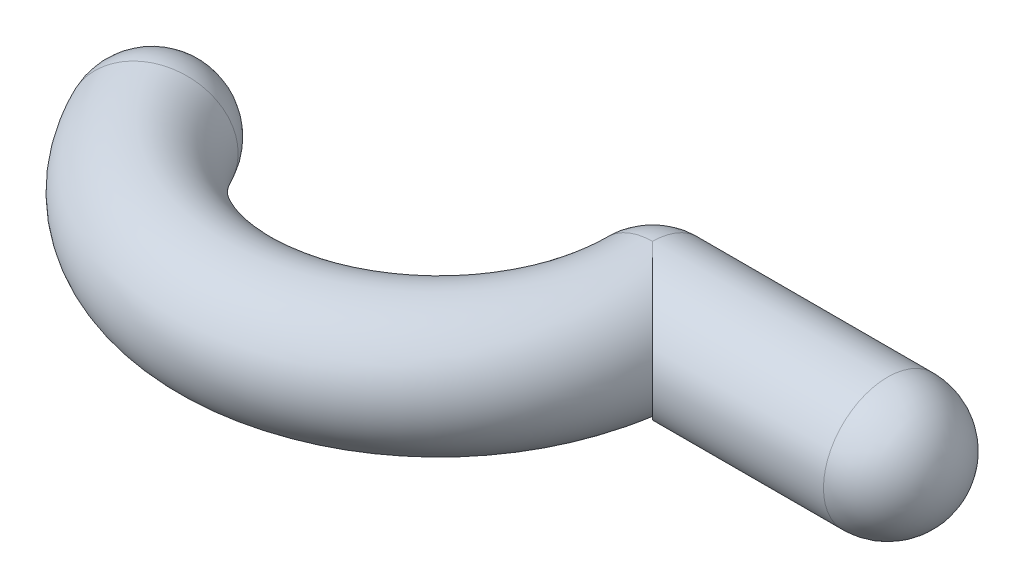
ISO-10303-21;
HEADER;
FILE_DESCRIPTION(('STEP AP214'),'2;1');
FILE_NAME('part.step','',(''),(''),'','','');
FILE_SCHEMA(('AUTOMOTIVE_DESIGN { 1 0 10303 214 1 1 1 1 }'));
ENDSEC;
DATA;
#1=APPLICATION_CONTEXT('core data for automotive mechanical design processes');
#2=APPLICATION_PROTOCOL_DEFINITION('international standard','automotive_design',2000,#1);
#3=PRODUCT_CONTEXT('',#1,'mechanical');
#4=PRODUCT('Part','Part','',(#3));
#5=PRODUCT_RELATED_PRODUCT_CATEGORY('part','',(#4));
#6=PRODUCT_DEFINITION_FORMATION('','',#4);
#7=PRODUCT_DEFINITION_CONTEXT('part definition',#1,'design');
#8=PRODUCT_DEFINITION('design','',#6,#7);
#9=PRODUCT_DEFINITION_SHAPE('','',#8);
#10=(LENGTH_UNIT() NAMED_UNIT(*) SI_UNIT(.MILLI.,.METRE.));
#11=(NAMED_UNIT(*) PLANE_ANGLE_UNIT() SI_UNIT($,.RADIAN.));
#12=(NAMED_UNIT(*) SI_UNIT($,.STERADIAN.) SOLID_ANGLE_UNIT());
#13=UNCERTAINTY_MEASURE_WITH_UNIT(LENGTH_MEASURE(1.E-05),#10,'distance_accuracy_value','');
#14=(GEOMETRIC_REPRESENTATION_CONTEXT(3) GLOBAL_UNCERTAINTY_ASSIGNED_CONTEXT((#13)) GLOBAL_UNIT_ASSIGNED_CONTEXT((#10,
#11,#12)) REPRESENTATION_CONTEXT('',''));
#15=CARTESIAN_POINT('',(0.,0.,0.));
#16=DIRECTION('',(0.,0.,1.));
#17=DIRECTION('',(1.,0.,0.));
#18=AXIS2_PLACEMENT_3D('',#15,#16,#17);
#19=CARTESIAN_POINT('',(-22.5,115.58,-1.11022302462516E-13));
#20=DIRECTION('',(1.,0.,0.));
#21=DIRECTION('',(0.,1.,0.));
#22=AXIS2_PLACEMENT_3D('',#19,#20,#21);
#23=CYLINDRICAL_SURFACE('',#22,1.5);
#24=CARTESIAN_POINT('',(-17.,115.58,-1.11022302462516E-13));
#25=DIRECTION('',(1.,0.,0.));
#26=DIRECTION('',(0.,0.,1.));
#27=AXIS2_PLACEMENT_3D('',#24,#25,#26);
#28=CIRCLE('',#27,1.5);
#29=CARTESIAN_POINT('',(-17.,117.08,-1.11297838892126E-13));
#30=VERTEX_POINT('',#29);
#31=CARTESIAN_POINT('',(-17.,114.08,-1.10930456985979E-13));
#32=VERTEX_POINT('',#31);
#33=EDGE_CURVE('E65',#30,#32,#28,.T.);
#34=ORIENTED_EDGE('',*,*,#33,.F.);
#35=CARTESIAN_POINT('',(-17.,115.58,-1.11022302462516E-13));
#36=DIRECTION('',(-1.,0.,0.));
#37=DIRECTION('',(0.,0.,-1.));
#38=AXIS2_PLACEMENT_3D('',#35,#36,#37);
#39=CIRCLE('',#38,1.5);
#40=EDGE_CURVE('E37',#30,#32,#39,.T.);
#41=ORIENTED_EDGE('',*,*,#40,.T.);
#42=EDGE_LOOP('',(#34,#41));
#43=FACE_BOUND('',#42,.T.);
#44=CARTESIAN_POINT('',(-22.5,115.58,-1.11022302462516E-13));
#45=DIRECTION('',(-1.,0.,0.));
#46=DIRECTION('',(0.,0.,-1.));
#47=AXIS2_PLACEMENT_3D('',#44,#45,#46);
#48=CIRCLE('',#47,1.5);
#49=CARTESIAN_POINT('',(-22.5,117.08,-1.14491749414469E-13));
#50=VERTEX_POINT('',#49);
#51=CARTESIAN_POINT('',(-22.5,114.08,-1.14491749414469E-13));
#52=VERTEX_POINT('',#51);
#53=EDGE_CURVE('E11',#50,#52,#48,.T.);
#54=ORIENTED_EDGE('',*,*,#53,.F.);
#55=CARTESIAN_POINT('',(-22.5,115.58,-1.11022302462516E-13));
#56=DIRECTION('',(0.707106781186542,0.,-0.707106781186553));
#57=DIRECTION('',(0.707106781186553,0.,0.707106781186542));
#58=AXIS2_PLACEMENT_3D('',#55,#56,#57);
#59=ELLIPSE('',#58,2.12132034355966,1.5);
#60=EDGE_CURVE('E24',#52,#50,#59,.F.);
#61=ORIENTED_EDGE('',*,*,#60,.F.);
#62=EDGE_LOOP('',(#54,#61));
#63=FACE_BOUND('',#62,.T.);
#64=ADVANCED_FACE('F16',(#43,#63),#23,.T.);
#65=CARTESIAN_POINT('',(-22.5,115.58,-1.11022302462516E-13));
#66=DIRECTION('',(-0.707106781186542,0.,0.707106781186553));
#67=DIRECTION('',(-0.707106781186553,0.,-0.707106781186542));
#68=AXIS2_PLACEMENT_3D('',#65,#66,#67);
#69=PLANE('',#68);
#70=CARTESIAN_POINT('',(-22.5002,117.079999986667,-0.000200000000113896));
#71=CARTESIAN_POINT('',(-22.4112123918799,117.080057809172,0.0887876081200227));
#72=CARTESIAN_POINT('',(-22.3218550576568,117.072091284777,0.178144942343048));
#73=CARTESIAN_POINT('',(-22.1441856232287,117.03752937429,0.355814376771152));
#74=CARTESIAN_POINT('',(-22.0558903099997,117.010765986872,0.444109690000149));
#75=CARTESIAN_POINT('',(-21.9002486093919,116.943077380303,0.599751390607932));
#76=CARTESIAN_POINT('',(-21.8321194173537,116.905828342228,0.667880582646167));
#77=CARTESIAN_POINT('',(-21.7010857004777,116.816531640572,0.798914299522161));
#78=CARTESIAN_POINT('',(-21.6381635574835,116.764536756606,0.861836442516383));
#79=CARTESIAN_POINT('',(-21.5294292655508,116.655043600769,0.970570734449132));
#80=CARTESIAN_POINT('',(-21.482494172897,116.599784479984,1.01750582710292));
#81=CARTESIAN_POINT('',(-21.3956633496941,116.478986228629,1.10433665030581));
#82=CARTESIAN_POINT('',(-21.3557701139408,116.413443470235,1.14422988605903));
#83=CARTESIAN_POINT('',(-21.2846837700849,116.272778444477,1.21531622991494));
#84=CARTESIAN_POINT('',(-21.253550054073,116.197595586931,1.24644994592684));
#85=CARTESIAN_POINT('',(-21.2021420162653,116.040131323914,1.29785798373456));
#86=CARTESIAN_POINT('',(-21.1818585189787,115.957855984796,1.31814148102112));
#87=CARTESIAN_POINT('',(-21.155202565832,115.799673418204,1.34479743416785));
#88=CARTESIAN_POINT('',(-21.1474191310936,115.724238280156,1.35258086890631));
#89=CARTESIAN_POINT('',(-21.1415890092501,115.572630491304,1.35841099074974));
#90=CARTESIAN_POINT('',(-21.143538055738,115.496458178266,1.35646194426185));
#91=CARTESIAN_POINT('',(-21.1566241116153,115.350664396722,1.3433758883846));
#92=CARTESIAN_POINT('',(-21.1671690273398,115.28093436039,1.33283097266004));
#93=CARTESIAN_POINT('',(-21.1961935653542,115.14487880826,1.30380643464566));
#94=CARTESIAN_POINT('',(-21.2146731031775,115.078553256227,1.28532689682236));
#95=CARTESIAN_POINT('',(-21.259325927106,114.949268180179,1.24067407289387));
#96=CARTESIAN_POINT('',(-21.2856798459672,114.886434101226,1.21432015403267));
#97=CARTESIAN_POINT('',(-21.3448386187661,114.767189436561,1.15516138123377));
#98=CARTESIAN_POINT('',(-21.3776456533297,114.710781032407,1.12235434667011));
#99=CARTESIAN_POINT('',(-21.4521101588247,114.599921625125,1.04788984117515));
#100=CARTESIAN_POINT('',(-21.4943224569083,114.546218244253,1.0056775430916));
#101=CARTESIAN_POINT('',(-21.5837348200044,114.447962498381,0.916265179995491));
#102=CARTESIAN_POINT('',(-21.6309365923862,114.403413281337,0.869063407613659));
#103=CARTESIAN_POINT('',(-21.7500531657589,114.306359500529,0.749946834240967));
#104=CARTESIAN_POINT('',(-21.8239060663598,114.258596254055,0.676093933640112));
#105=CARTESIAN_POINT('',(-21.9762412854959,114.180658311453,0.523758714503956));
#106=CARTESIAN_POINT('',(-22.0547372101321,114.150538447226,0.445262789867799));
#107=CARTESIAN_POINT('',(-22.1947255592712,114.111670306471,0.305274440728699));
#108=CARTESIAN_POINT('',(-22.2557724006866,114.099526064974,0.244227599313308));
#109=CARTESIAN_POINT('',(-22.3779656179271,114.083718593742,0.122034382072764));
#110=CARTESIAN_POINT('',(-22.439107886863,114.079993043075,0.060892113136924));
#111=CARTESIAN_POINT('',(-22.5002,114.080000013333,-0.000200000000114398));
#112=B_SPLINE_CURVE_WITH_KNOTS('',3,(#70,#71,#72,#73,#74,#75,#76,#77,#78,#79,#80,#81,#82,#83,
#84,#85,#86,#87,#88,#89,#90,#91,#92,#93,#94,#95,#96,#97,#98,#99,#100,#101,#102,#103,#104,#105,
#106,#107,#108,#109,#110,#111),.UNSPECIFIED.,.F.,.F.,(4,2,2,2,2,2,2,2,2,2,2,2,2,2,2,2,2,2,2,2,
4),(0.,0.378117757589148,0.759658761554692,1.06840499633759,1.37605979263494,1.63410827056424,
1.89224798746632,2.15209795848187,2.41172783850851,2.63922530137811,2.86662304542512,
3.07956177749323,3.29249824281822,3.51075304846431,3.72908173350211,3.96904126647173,
4.20908317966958,4.55174763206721,4.89547143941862,5.15661752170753,5.41582399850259),.UNSPECIFIED.);
#113=EDGE_CURVE('E70',#50,#52,#112,.T.);
#114=ORIENTED_EDGE('',*,*,#113,.T.);
#115=ORIENTED_EDGE('',*,*,#60,.T.);
#116=EDGE_LOOP('',(#114,#115));
#117=FACE_BOUND('',#116,.T.);
#118=ADVANCED_FACE('F89',(#117),#69,.T.);
#119=CARTESIAN_POINT('',(-22.5,115.58,-1.14491749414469E-13));
#120=DIRECTION('',(0.,1.,0.));
#121=DIRECTION('',(1.,0.,0.));
#122=AXIS2_PLACEMENT_3D('',#119,#120,#121);
#123=SPHERICAL_SURFACE('',#122,1.5);
#124=CARTESIAN_POINT('',(-22.5,115.58,-1.14491749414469E-13));
#125=DIRECTION('',(0.,0.,1.));
#126=DIRECTION('',(-1.,0.,0.));
#127=AXIS2_PLACEMENT_3D('',#124,#125,#126);
#128=CIRCLE('',#127,1.5);
#129=EDGE_CURVE('E79',#50,#52,#128,.T.);
#130=ORIENTED_EDGE('',*,*,#129,.F.);
#131=ORIENTED_EDGE('',*,*,#53,.T.);
#132=EDGE_LOOP('',(#130,#131));
#133=FACE_BOUND('',#132,.T.);
#134=ADVANCED_FACE('F86',(#133),#123,.T.);
#135=CARTESIAN_POINT('',(-27.5,115.58,0.));
#136=DIRECTION('',(0.,-1.,0.));
#137=DIRECTION('',(0.,0.,-1.));
#138=AXIS2_PLACEMENT_3D('',#135,#136,#137);
#139=TOROIDAL_SURFACE('',#138,5.,1.5);
#140=ORIENTED_EDGE('',*,*,#113,.F.);
#141=ORIENTED_EDGE('',*,*,#129,.T.);
#142=EDGE_LOOP('',(#140,#141));
#143=FACE_BOUND('',#142,.T.);
#144=CARTESIAN_POINT('',(-31.9721359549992,115.579999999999,2.23606797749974));
#145=DIRECTION('',(-0.447213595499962,0.,-0.894427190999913));
#146=DIRECTION('',(0.89442719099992,0.,-0.447213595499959));
#147=AXIS2_PLACEMENT_3D('',#144,#145,#146);
#148=CIRCLE('',#147,1.5);
#149=CARTESIAN_POINT('',(-31.9721359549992,117.08,2.23606797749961));
#150=VERTEX_POINT('',#149);
#151=CARTESIAN_POINT('',(-31.9721359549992,114.079999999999,2.23606797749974));
#152=VERTEX_POINT('',#151);
#153=EDGE_CURVE('E50',#150,#152,#148,.T.);
#154=ORIENTED_EDGE('',*,*,#153,.F.);
#155=CARTESIAN_POINT('',(-31.9721359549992,115.579999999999,2.23606797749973));
#156=DIRECTION('',(0.447213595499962,0.,0.894427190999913));
#157=DIRECTION('',(-0.89442719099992,0.,0.447213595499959));
#158=AXIS2_PLACEMENT_3D('',#155,#156,#157);
#159=CIRCLE('',#158,1.5);
#160=EDGE_CURVE('E30',#150,#152,#159,.T.);
#161=ORIENTED_EDGE('',*,*,#160,.T.);
#162=EDGE_LOOP('',(#154,#161));
#163=FACE_BOUND('',#162,.T.);
#164=ADVANCED_FACE('F49',(#143,#163),#139,.T.);
#165=CARTESIAN_POINT('',(-17.,115.58,-1.11022302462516E-13));
#166=DIRECTION('',(0.,-1.,0.));
#167=DIRECTION('',(0.,0.,-1.));
#168=AXIS2_PLACEMENT_3D('',#165,#166,#167);
#169=SPHERICAL_SURFACE('',#168,1.5);
#170=CARTESIAN_POINT('',(-17.,115.58,-1.11022302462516E-13));
#171=DIRECTION('',(1.,0.,0.));
#172=DIRECTION('',(0.,0.,1.));
#173=AXIS2_PLACEMENT_3D('',#170,#171,#172);
#174=SPHERICAL_SURFACE('',#173,1.5);
#175=ORIENTED_EDGE('',*,*,#33,.T.);
#176=ORIENTED_EDGE('',*,*,#40,.F.);
#177=EDGE_LOOP('',(#175,#176));
#178=FACE_BOUND('',#177,.T.);
#179=ADVANCED_FACE('F85',(#178),#174,.T.);
#180=CARTESIAN_POINT('',(-31.9721359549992,115.579999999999,2.23606797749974));
#181=DIRECTION('',(0.,-1.,0.));
#182=DIRECTION('',(-0.89442719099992,0.,0.447213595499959));
#183=AXIS2_PLACEMENT_3D('',#180,#181,#182);
#184=SPHERICAL_SURFACE('',#183,1.5);
#185=CARTESIAN_POINT('',(-31.9721359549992,115.579999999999,2.23606797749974));
#186=DIRECTION('',(-0.447213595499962,0.,-0.894427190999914));
#187=DIRECTION('',(0.894427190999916,0.,-0.447213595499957));
#188=AXIS2_PLACEMENT_3D('',#185,#186,#187);
#189=SPHERICAL_SURFACE('',#188,1.5);
#190=ORIENTED_EDGE('',*,*,#153,.T.);
#191=ORIENTED_EDGE('',*,*,#160,.F.);
#192=EDGE_LOOP('',(#190,#191));
#193=FACE_BOUND('',#192,.T.);
#194=ADVANCED_FACE('F53',(#193),#189,.T.);
#195=CLOSED_SHELL('',(#64,#118,#134,#164,#179,#194));
#196=MANIFOLD_SOLID_BREP('B1',#195);
#197=ADVANCED_BREP_SHAPE_REPRESENTATION('',(#18,#196),#14);
#198=SHAPE_DEFINITION_REPRESENTATION(#9,#197);
ENDSEC;
END-ISO-10303-21;
